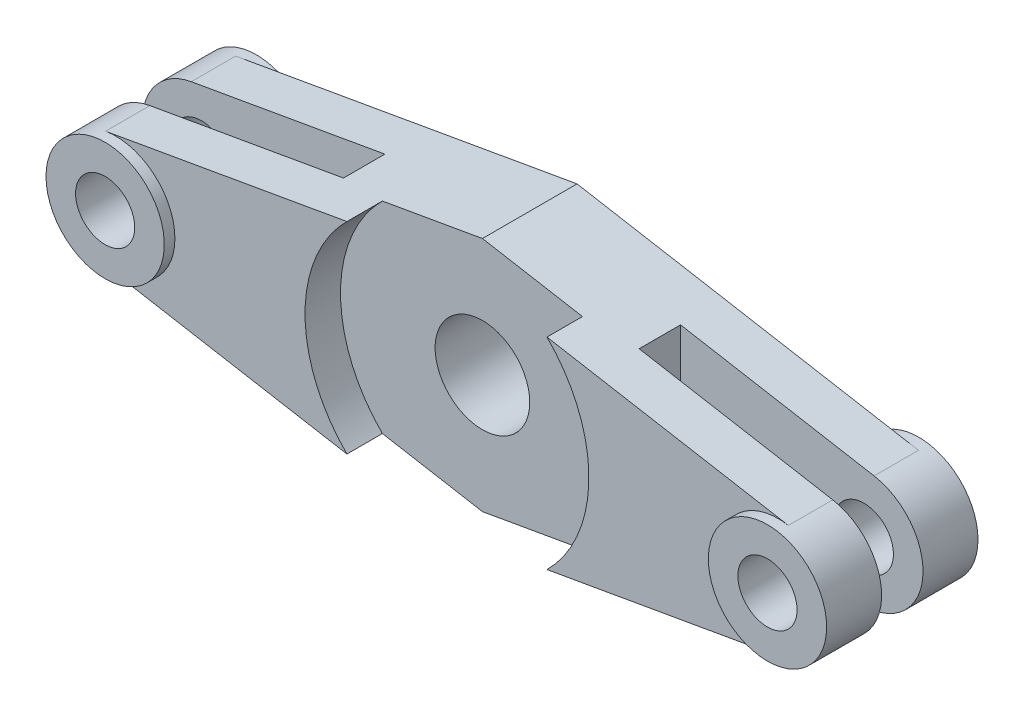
ISO-10303-21;
HEADER;
FILE_DESCRIPTION(('STEP AP214'),'2;1');
FILE_NAME('part.step','',(''),(''),'','','');
FILE_SCHEMA(('AUTOMOTIVE_DESIGN { 1 0 10303 214 1 1 1 1 }'));
ENDSEC;
DATA;
#1=APPLICATION_CONTEXT('core data for automotive mechanical design processes');
#2=APPLICATION_PROTOCOL_DEFINITION('international standard','automotive_design',2000,#1);
#3=PRODUCT_CONTEXT('',#1,'mechanical');
#4=PRODUCT('Part','Part','',(#3));
#5=PRODUCT_RELATED_PRODUCT_CATEGORY('part','',(#4));
#6=PRODUCT_DEFINITION_FORMATION('','',#4);
#7=PRODUCT_DEFINITION_CONTEXT('part definition',#1,'design');
#8=PRODUCT_DEFINITION('design','',#6,#7);
#9=PRODUCT_DEFINITION_SHAPE('','',#8);
#10=(LENGTH_UNIT() NAMED_UNIT(*) SI_UNIT(.MILLI.,.METRE.));
#11=(NAMED_UNIT(*) PLANE_ANGLE_UNIT() SI_UNIT($,.RADIAN.));
#12=(NAMED_UNIT(*) SI_UNIT($,.STERADIAN.) SOLID_ANGLE_UNIT());
#13=UNCERTAINTY_MEASURE_WITH_UNIT(LENGTH_MEASURE(1.E-05),#10,'distance_accuracy_value','');
#14=(GEOMETRIC_REPRESENTATION_CONTEXT(3) GLOBAL_UNCERTAINTY_ASSIGNED_CONTEXT((#13)) GLOBAL_UNIT_ASSIGNED_CONTEXT((#10,
#11,#12)) REPRESENTATION_CONTEXT('',''));
#15=CARTESIAN_POINT('',(0.,0.,0.));
#16=DIRECTION('',(0.,0.,1.));
#17=DIRECTION('',(1.,0.,0.));
#18=AXIS2_PLACEMENT_3D('',#15,#16,#17);
#19=CARTESIAN_POINT('',(28.,0.,5.5));
#20=DIRECTION('',(0.,0.,1.));
#21=DIRECTION('',(1.,0.,0.));
#22=AXIS2_PLACEMENT_3D('',#19,#20,#21);
#23=PLANE('',#22);
#24=CARTESIAN_POINT('',(0.,0.,5.5));
#25=DIRECTION('',(0.,0.,1.));
#26=DIRECTION('',(1.,0.,0.));
#27=AXIS2_PLACEMENT_3D('',#24,#25,#26);
#28=CIRCLE('',#27,12.);
#29=CARTESIAN_POINT('',(-8.45758715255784,8.5128855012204,5.5));
#30=VERTEX_POINT('',#29);
#31=CARTESIAN_POINT('',(-8.45758715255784,-8.5128855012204,5.5));
#32=VERTEX_POINT('',#31);
#33=EDGE_CURVE('E167',#30,#32,#28,.T.);
#34=ORIENTED_EDGE('',*,*,#33,.F.);
#35=DIRECTION('',(-0.984891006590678,-0.173175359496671,0.));
#36=VECTOR('',#35,1.);
#37=CARTESIAN_POINT('',(0.,10.,5.5));
#38=LINE('',#37,#36);
#39=CARTESIAN_POINT('',(-28.8658767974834,4.92445503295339,5.5));
#40=VERTEX_POINT('',#39);
#41=EDGE_CURVE('E184',#30,#40,#38,.T.);
#42=ORIENTED_EDGE('',*,*,#41,.T.);
#43=CARTESIAN_POINT('',(-28.,0.,5.5));
#44=DIRECTION('',(0.,0.,1.));
#45=DIRECTION('',(-1.,0.,0.));
#46=AXIS2_PLACEMENT_3D('',#43,#44,#45);
#47=CIRCLE('',#46,5.);
#48=CARTESIAN_POINT('',(-28.8658767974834,-4.92445503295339,5.5));
#49=VERTEX_POINT('',#48);
#50=EDGE_CURVE('E469',#49,#40,#47,.T.);
#51=ORIENTED_EDGE('',*,*,#50,.F.);
#52=DIRECTION('',(0.984891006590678,-0.173175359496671,0.));
#53=VECTOR('',#52,1.);
#54=CARTESIAN_POINT('',(0.,-10.,5.5));
#55=LINE('',#54,#53);
#56=EDGE_CURVE('E187',#49,#32,#55,.T.);
#57=ORIENTED_EDGE('',*,*,#56,.T.);
#58=EDGE_LOOP('',(#34,#42,#51,#57));
#59=FACE_BOUND('',#58,.T.);
#60=ADVANCED_FACE('F33',(#59),#23,.T.);
#61=CARTESIAN_POINT('',(-28.,0.,5.5));
#62=DIRECTION('',(0.,0.,-1.));
#63=DIRECTION('',(-1.,0.,0.));
#64=AXIS2_PLACEMENT_3D('',#61,#62,#63);
#65=CYLINDRICAL_SURFACE('',#64,5.);
#66=CARTESIAN_POINT('',(-28.,0.,6.4));
#67=DIRECTION('',(0.,0.,1.));
#68=DIRECTION('',(-1.,0.,0.));
#69=AXIS2_PLACEMENT_3D('',#66,#67,#68);
#70=CIRCLE('',#69,5.);
#71=CARTESIAN_POINT('',(-33.,0.,6.4));
#72=VERTEX_POINT('',#71);
#73=EDGE_CURVE('E470',#72,#72,#70,.T.);
#74=ORIENTED_EDGE('',*,*,#73,.F.);
#75=EDGE_LOOP('',(#74));
#76=FACE_BOUND('',#75,.T.);
#77=CARTESIAN_POINT('',(-28.,0.,1.75));
#78=DIRECTION('',(0.,0.,-1.));
#79=DIRECTION('',(-1.,0.,0.));
#80=AXIS2_PLACEMENT_3D('',#77,#78,#79);
#81=CIRCLE('',#80,5.);
#82=CARTESIAN_POINT('',(-28.8658767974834,-4.92445503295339,1.75));
#83=VERTEX_POINT('',#82);
#84=CARTESIAN_POINT('',(-28.8658767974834,4.92445503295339,1.75));
#85=VERTEX_POINT('',#84);
#86=EDGE_CURVE('E238',#83,#85,#81,.T.);
#87=ORIENTED_EDGE('',*,*,#86,.F.);
#88=DIRECTION('',(0.,0.,-1.));
#89=VECTOR('',#88,1.);
#90=CARTESIAN_POINT('',(-28.8658767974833,-4.92445503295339,5.5));
#91=LINE('',#90,#89);
#92=EDGE_CURVE('E444',#49,#83,#91,.T.);
#93=ORIENTED_EDGE('',*,*,#92,.F.);
#94=ORIENTED_EDGE('',*,*,#50,.T.);
#95=DIRECTION('',(0.,0.,-1.));
#96=VECTOR('',#95,1.);
#97=CARTESIAN_POINT('',(-28.8658767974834,4.92445503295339,5.5));
#98=LINE('',#97,#96);
#99=EDGE_CURVE('E447',#40,#85,#98,.T.);
#100=ORIENTED_EDGE('',*,*,#99,.T.);
#101=EDGE_LOOP('',(#87,#93,#94,#100));
#102=FACE_BOUND('',#101,.T.);
#103=ADVANCED_FACE('F349',(#76,#102),#65,.T.);
#104=CARTESIAN_POINT('',(-28.,0.,5.5));
#105=DIRECTION('',(0.,0.,-1.));
#106=DIRECTION('',(-1.,0.,0.));
#107=AXIS2_PLACEMENT_3D('',#104,#105,#106);
#108=CYLINDRICAL_SURFACE('',#107,2.5);
#109=CARTESIAN_POINT('',(-28.,0.,6.4));
#110=DIRECTION('',(0.,0.,1.));
#111=DIRECTION('',(-1.,0.,0.));
#112=AXIS2_PLACEMENT_3D('',#109,#110,#111);
#113=CIRCLE('',#112,2.5);
#114=CARTESIAN_POINT('',(-30.5,0.,6.4));
#115=VERTEX_POINT('',#114);
#116=EDGE_CURVE('E292',#115,#115,#113,.T.);
#117=ORIENTED_EDGE('',*,*,#116,.T.);
#118=EDGE_LOOP('',(#117));
#119=FACE_BOUND('',#118,.T.);
#120=CARTESIAN_POINT('',(-28.,0.,1.75));
#121=DIRECTION('',(0.,0.,-1.));
#122=DIRECTION('',(-1.,0.,0.));
#123=AXIS2_PLACEMENT_3D('',#120,#121,#122);
#124=CIRCLE('',#123,2.5);
#125=CARTESIAN_POINT('',(-30.5,0.,1.75));
#126=VERTEX_POINT('',#125);
#127=EDGE_CURVE('E225',#126,#126,#124,.T.);
#128=ORIENTED_EDGE('',*,*,#127,.T.);
#129=EDGE_LOOP('',(#128));
#130=FACE_BOUND('',#129,.T.);
#131=ADVANCED_FACE('F346',(#119,#130),#108,.F.);
#132=CARTESIAN_POINT('',(28.,0.,5.5));
#133=DIRECTION('',(0.,0.,-1.));
#134=DIRECTION('',(-1.,0.,0.));
#135=AXIS2_PLACEMENT_3D('',#132,#133,#134);
#136=CYLINDRICAL_SURFACE('',#135,5.);
#137=CARTESIAN_POINT('',(28.,0.,6.4));
#138=DIRECTION('',(0.,0.,1.));
#139=DIRECTION('',(1.,0.,0.));
#140=AXIS2_PLACEMENT_3D('',#137,#138,#139);
#141=CIRCLE('',#140,5.);
#142=CARTESIAN_POINT('',(33.,0.,6.4));
#143=VERTEX_POINT('',#142);
#144=EDGE_CURVE('E304',#143,#143,#141,.T.);
#145=ORIENTED_EDGE('',*,*,#144,.F.);
#146=EDGE_LOOP('',(#145));
#147=FACE_BOUND('',#146,.T.);
#148=CARTESIAN_POINT('',(28.,0.,1.75));
#149=DIRECTION('',(0.,0.,-1.));
#150=DIRECTION('',(-1.,0.,0.));
#151=AXIS2_PLACEMENT_3D('',#148,#149,#150);
#152=CIRCLE('',#151,5.);
#153=CARTESIAN_POINT('',(28.8658767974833,4.92445503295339,1.75));
#154=VERTEX_POINT('',#153);
#155=CARTESIAN_POINT('',(28.8658767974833,-4.92445503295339,1.75));
#156=VERTEX_POINT('',#155);
#157=EDGE_CURVE('E260',#154,#156,#152,.T.);
#158=ORIENTED_EDGE('',*,*,#157,.F.);
#159=DIRECTION('',(0.,0.,-1.));
#160=VECTOR('',#159,1.);
#161=CARTESIAN_POINT('',(28.8658767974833,4.92445503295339,5.5));
#162=LINE('',#161,#160);
#163=CARTESIAN_POINT('',(28.8658767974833,4.92445503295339,5.5));
#164=VERTEX_POINT('',#163);
#165=EDGE_CURVE('E214',#164,#154,#162,.T.);
#166=ORIENTED_EDGE('',*,*,#165,.F.);
#167=CARTESIAN_POINT('',(28.,0.,5.5));
#168=DIRECTION('',(0.,0.,1.));
#169=DIRECTION('',(1.,0.,0.));
#170=AXIS2_PLACEMENT_3D('',#167,#168,#169);
#171=CIRCLE('',#170,5.);
#172=CARTESIAN_POINT('',(28.8658767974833,-4.92445503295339,5.5));
#173=VERTEX_POINT('',#172);
#174=EDGE_CURVE('E183',#164,#173,#171,.T.);
#175=ORIENTED_EDGE('',*,*,#174,.T.);
#176=DIRECTION('',(0.,0.,-1.));
#177=VECTOR('',#176,1.);
#178=CARTESIAN_POINT('',(28.8658767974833,-4.92445503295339,5.5));
#179=LINE('',#178,#177);
#180=EDGE_CURVE('E200',#173,#156,#179,.T.);
#181=ORIENTED_EDGE('',*,*,#180,.T.);
#182=EDGE_LOOP('',(#158,#166,#175,#181));
#183=FACE_BOUND('',#182,.T.);
#184=ADVANCED_FACE('F336',(#147,#183),#136,.T.);
#185=CARTESIAN_POINT('',(28.,0.,5.5));
#186=DIRECTION('',(0.,0.,-1.));
#187=DIRECTION('',(-1.,0.,0.));
#188=AXIS2_PLACEMENT_3D('',#185,#186,#187);
#189=CYLINDRICAL_SURFACE('',#188,2.5);
#190=CARTESIAN_POINT('',(28.,0.,6.4));
#191=DIRECTION('',(0.,0.,1.));
#192=DIRECTION('',(1.,0.,0.));
#193=AXIS2_PLACEMENT_3D('',#190,#191,#192);
#194=CIRCLE('',#193,2.5);
#195=CARTESIAN_POINT('',(30.5,0.,6.4));
#196=VERTEX_POINT('',#195);
#197=EDGE_CURVE('E463',#196,#196,#194,.T.);
#198=ORIENTED_EDGE('',*,*,#197,.T.);
#199=EDGE_LOOP('',(#198));
#200=FACE_BOUND('',#199,.T.);
#201=CARTESIAN_POINT('',(28.,0.,1.75));
#202=DIRECTION('',(0.,0.,-1.));
#203=DIRECTION('',(-1.,0.,0.));
#204=AXIS2_PLACEMENT_3D('',#201,#202,#203);
#205=CIRCLE('',#204,2.5);
#206=CARTESIAN_POINT('',(25.5,0.,1.75));
#207=VERTEX_POINT('',#206);
#208=EDGE_CURVE('E257',#207,#207,#205,.T.);
#209=ORIENTED_EDGE('',*,*,#208,.T.);
#210=EDGE_LOOP('',(#209));
#211=FACE_BOUND('',#210,.T.);
#212=ADVANCED_FACE('F322',(#200,#211),#189,.F.);
#213=CARTESIAN_POINT('',(8.45758715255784,-8.5128855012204,5.5));
#214=VERTEX_POINT('',#213);
#215=CARTESIAN_POINT('',(8.45758715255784,8.5128855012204,5.5));
#216=VERTEX_POINT('',#215);
#217=EDGE_CURVE('E158',#214,#216,#28,.T.);
#218=ORIENTED_EDGE('',*,*,#217,.F.);
#219=DIRECTION('',(0.984891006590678,0.173175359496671,0.));
#220=VECTOR('',#219,1.);
#221=CARTESIAN_POINT('',(0.,-10.,5.5));
#222=LINE('',#221,#220);
#223=EDGE_CURVE('E203',#214,#173,#222,.T.);
#224=ORIENTED_EDGE('',*,*,#223,.T.);
#225=ORIENTED_EDGE('',*,*,#174,.F.);
#226=DIRECTION('',(-0.984891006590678,0.173175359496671,0.));
#227=VECTOR('',#226,1.);
#228=CARTESIAN_POINT('',(0.,10.,5.5));
#229=LINE('',#228,#227);
#230=EDGE_CURVE('E175',#164,#216,#229,.T.);
#231=ORIENTED_EDGE('',*,*,#230,.T.);
#232=EDGE_LOOP('',(#218,#224,#225,#231));
#233=FACE_BOUND('',#232,.T.);
#234=ADVANCED_FACE('F181',(#233),#23,.T.);
#235=CARTESIAN_POINT('',(28.,0.,-5.5));
#236=DIRECTION('',(0.,0.,1.));
#237=DIRECTION('',(1.,0.,0.));
#238=AXIS2_PLACEMENT_3D('',#235,#236,#237);
#239=PLANE('',#238);
#240=CARTESIAN_POINT('',(0.,0.,-5.5));
#241=DIRECTION('',(0.,0.,1.));
#242=DIRECTION('',(1.,0.,0.));
#243=AXIS2_PLACEMENT_3D('',#240,#241,#242);
#244=CIRCLE('',#243,4.);
#245=CARTESIAN_POINT('',(4.,0.,-5.5));
#246=VERTEX_POINT('',#245);
#247=EDGE_CURVE('E168',#246,#246,#244,.T.);
#248=ORIENTED_EDGE('',*,*,#247,.T.);
#249=EDGE_LOOP('',(#248));
#250=FACE_BOUND('',#249,.T.);
#251=DIRECTION('',(0.984891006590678,-0.173175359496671,0.));
#252=VECTOR('',#251,1.);
#253=CARTESIAN_POINT('',(0.,-10.,-5.5));
#254=LINE('',#253,#252);
#255=CARTESIAN_POINT('',(-28.8658767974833,-4.92445503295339,-5.5));
#256=VERTEX_POINT('',#255);
#257=CARTESIAN_POINT('',(0.,-10.,-5.5));
#258=VERTEX_POINT('',#257);
#259=EDGE_CURVE('E190',#256,#258,#254,.T.);
#260=ORIENTED_EDGE('',*,*,#259,.F.);
#261=CARTESIAN_POINT('',(-28.,0.,-5.5));
#262=DIRECTION('',(0.,0.,1.));
#263=DIRECTION('',(-1.,0.,0.));
#264=AXIS2_PLACEMENT_3D('',#261,#262,#263);
#265=CIRCLE('',#264,5.);
#266=CARTESIAN_POINT('',(-28.8658767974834,4.92445503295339,-5.5));
#267=VERTEX_POINT('',#266);
#268=EDGE_CURVE('E279',#256,#267,#265,.T.);
#269=ORIENTED_EDGE('',*,*,#268,.T.);
#270=DIRECTION('',(-0.984891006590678,-0.173175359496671,0.));
#271=VECTOR('',#270,1.);
#272=CARTESIAN_POINT('',(0.,10.,-5.5));
#273=LINE('',#272,#271);
#274=CARTESIAN_POINT('',(0.,10.,-5.5));
#275=VERTEX_POINT('',#274);
#276=EDGE_CURVE('E303',#275,#267,#273,.T.);
#277=ORIENTED_EDGE('',*,*,#276,.F.);
#278=DIRECTION('',(-0.984891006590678,0.173175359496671,0.));
#279=VECTOR('',#278,1.);
#280=CARTESIAN_POINT('',(0.,10.,-5.5));
#281=LINE('',#280,#279);
#282=CARTESIAN_POINT('',(28.8658767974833,4.92445503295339,-5.5));
#283=VERTEX_POINT('',#282);
#284=EDGE_CURVE('E300',#283,#275,#281,.T.);
#285=ORIENTED_EDGE('',*,*,#284,.F.);
#286=CARTESIAN_POINT('',(28.,0.,-5.5));
#287=DIRECTION('',(0.,0.,1.));
#288=DIRECTION('',(1.,0.,0.));
#289=AXIS2_PLACEMENT_3D('',#286,#287,#288);
#290=CIRCLE('',#289,5.);
#291=CARTESIAN_POINT('',(28.8658767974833,-4.92445503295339,-5.5));
#292=VERTEX_POINT('',#291);
#293=EDGE_CURVE('E288',#283,#292,#290,.T.);
#294=ORIENTED_EDGE('',*,*,#293,.T.);
#295=DIRECTION('',(0.984891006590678,0.173175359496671,0.));
#296=VECTOR('',#295,1.);
#297=CARTESIAN_POINT('',(0.,-10.,-5.5));
#298=LINE('',#297,#296);
#299=EDGE_CURVE('E185',#258,#292,#298,.T.);
#300=ORIENTED_EDGE('',*,*,#299,.F.);
#301=EDGE_LOOP('',(#260,#269,#277,#285,#294,#300));
#302=FACE_BOUND('',#301,.T.);
#303=ADVANCED_FACE('F334',(#250,#302),#239,.F.);
#304=CARTESIAN_POINT('',(28.8658767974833,4.92445503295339,-1.75));
#305=VERTEX_POINT('',#304);
#306=EDGE_CURVE('E219',#305,#283,#162,.T.);
#307=ORIENTED_EDGE('',*,*,#306,.F.);
#308=CARTESIAN_POINT('',(28.,0.,-1.75));
#309=DIRECTION('',(0.,0.,-1.));
#310=DIRECTION('',(-1.,0.,0.));
#311=AXIS2_PLACEMENT_3D('',#308,#309,#310);
#312=CIRCLE('',#311,5.);
#313=CARTESIAN_POINT('',(28.8658767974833,-4.92445503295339,-1.75));
#314=VERTEX_POINT('',#313);
#315=EDGE_CURVE('E267',#305,#314,#312,.T.);
#316=ORIENTED_EDGE('',*,*,#315,.T.);
#317=EDGE_CURVE('E205',#314,#292,#179,.T.);
#318=ORIENTED_EDGE('',*,*,#317,.T.);
#319=ORIENTED_EDGE('',*,*,#293,.F.);
#320=EDGE_LOOP('',(#307,#316,#318,#319));
#321=FACE_BOUND('',#320,.T.);
#322=CARTESIAN_POINT('',(28.,0.,-6.4));
#323=DIRECTION('',(0.,0.,1.));
#324=DIRECTION('',(1.,0.,0.));
#325=AXIS2_PLACEMENT_3D('',#322,#323,#324);
#326=CIRCLE('',#325,5.);
#327=CARTESIAN_POINT('',(33.,0.,-6.4));
#328=VERTEX_POINT('',#327);
#329=EDGE_CURVE('E289',#328,#328,#326,.T.);
#330=ORIENTED_EDGE('',*,*,#329,.T.);
#331=EDGE_LOOP('',(#330));
#332=FACE_BOUND('',#331,.T.);
#333=ADVANCED_FACE('F35',(#321,#332),#136,.T.);
#334=CARTESIAN_POINT('',(0.,10.,5.5));
#335=DIRECTION('',(-0.173175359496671,-0.984891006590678,0.));
#336=DIRECTION('',(0.984891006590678,-0.173175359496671,0.));
#337=AXIS2_PLACEMENT_3D('',#334,#335,#336);
#338=PLANE('',#337);
#339=DIRECTION('',(-0.984891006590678,0.173175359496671,0.));
#340=VECTOR('',#339,1.);
#341=CARTESIAN_POINT('',(0.,10.,2.5));
#342=LINE('',#341,#340);
#343=CARTESIAN_POINT('',(8.45758715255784,8.5128855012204,2.5));
#344=VERTEX_POINT('',#343);
#345=CARTESIAN_POINT('',(0.,10.,2.5));
#346=VERTEX_POINT('',#345);
#347=EDGE_CURVE('E178',#344,#346,#342,.T.);
#348=ORIENTED_EDGE('',*,*,#347,.F.);
#349=DIRECTION('',(0.,0.,1.));
#350=VECTOR('',#349,1.);
#351=CARTESIAN_POINT('',(8.45758715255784,8.5128855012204,2.5));
#352=LINE('',#351,#350);
#353=EDGE_CURVE('E162',#344,#216,#352,.T.);
#354=ORIENTED_EDGE('',*,*,#353,.T.);
#355=ORIENTED_EDGE('',*,*,#230,.F.);
#356=ORIENTED_EDGE('',*,*,#165,.T.);
#357=DIRECTION('',(0.984891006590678,-0.173175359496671,0.));
#358=VECTOR('',#357,1.);
#359=CARTESIAN_POINT('',(0.,10.,1.75));
#360=LINE('',#359,#358);
#361=CARTESIAN_POINT('',(12.5,7.80209994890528,1.75));
#362=VERTEX_POINT('',#361);
#363=EDGE_CURVE('E262',#362,#154,#360,.T.);
#364=ORIENTED_EDGE('',*,*,#363,.F.);
#365=DIRECTION('',(0.,0.,-1.));
#366=VECTOR('',#365,1.);
#367=CARTESIAN_POINT('',(12.5,7.80209994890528,5.5));
#368=LINE('',#367,#366);
#369=CARTESIAN_POINT('',(12.5,7.80209994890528,-1.75));
#370=VERTEX_POINT('',#369);
#371=EDGE_CURVE('E273',#362,#370,#368,.T.);
#372=ORIENTED_EDGE('',*,*,#371,.T.);
#373=DIRECTION('',(0.984891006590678,-0.173175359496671,0.));
#374=VECTOR('',#373,1.);
#375=CARTESIAN_POINT('',(0.,10.,-1.75));
#376=LINE('',#375,#374);
#377=EDGE_CURVE('E270',#370,#305,#376,.T.);
#378=ORIENTED_EDGE('',*,*,#377,.T.);
#379=ORIENTED_EDGE('',*,*,#306,.T.);
#380=ORIENTED_EDGE('',*,*,#284,.T.);
#381=DIRECTION('',(0.,0.,-1.));
#382=VECTOR('',#381,1.);
#383=CARTESIAN_POINT('',(0.,10.,5.5));
#384=LINE('',#383,#382);
#385=EDGE_CURVE('E224',#346,#275,#384,.T.);
#386=ORIENTED_EDGE('',*,*,#385,.F.);
#387=EDGE_LOOP('',(#348,#354,#355,#356,#364,#372,#378,#379,#380,#386));
#388=FACE_BOUND('',#387,.T.);
#389=ADVANCED_FACE('F173',(#388),#338,.F.);
#390=CARTESIAN_POINT('',(0.,10.,5.5));
#391=DIRECTION('',(0.173175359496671,-0.984891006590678,0.));
#392=DIRECTION('',(0.984891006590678,0.173175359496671,0.));
#393=AXIS2_PLACEMENT_3D('',#390,#391,#392);
#394=PLANE('',#393);
#395=ORIENTED_EDGE('',*,*,#41,.F.);
#396=DIRECTION('',(0.,0.,1.));
#397=VECTOR('',#396,1.);
#398=CARTESIAN_POINT('',(-8.45758715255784,8.5128855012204,2.5));
#399=LINE('',#398,#397);
#400=CARTESIAN_POINT('',(-8.45758715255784,8.5128855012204,2.5));
#401=VERTEX_POINT('',#400);
#402=EDGE_CURVE('E179',#30,#401,#399,.F.);
#403=ORIENTED_EDGE('',*,*,#402,.T.);
#404=DIRECTION('',(-0.984891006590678,-0.173175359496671,0.));
#405=VECTOR('',#404,1.);
#406=CARTESIAN_POINT('',(0.,10.,2.5));
#407=LINE('',#406,#405);
#408=EDGE_CURVE('E428',#346,#401,#407,.T.);
#409=ORIENTED_EDGE('',*,*,#408,.F.);
#410=ORIENTED_EDGE('',*,*,#385,.T.);
#411=ORIENTED_EDGE('',*,*,#276,.T.);
#412=CARTESIAN_POINT('',(-28.8658767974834,4.92445503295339,-1.75));
#413=VERTEX_POINT('',#412);
#414=EDGE_CURVE('E450',#413,#267,#98,.T.);
#415=ORIENTED_EDGE('',*,*,#414,.F.);
#416=DIRECTION('',(0.984891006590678,0.173175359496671,0.));
#417=VECTOR('',#416,1.);
#418=CARTESIAN_POINT('',(0.,10.,-1.75));
#419=LINE('',#418,#417);
#420=CARTESIAN_POINT('',(-12.5,7.80209994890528,-1.75));
#421=VERTEX_POINT('',#420);
#422=EDGE_CURVE('E246',#413,#421,#419,.T.);
#423=ORIENTED_EDGE('',*,*,#422,.T.);
#424=DIRECTION('',(0.,0.,-1.));
#425=VECTOR('',#424,1.);
#426=CARTESIAN_POINT('',(-12.5,7.80209994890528,5.5));
#427=LINE('',#426,#425);
#428=CARTESIAN_POINT('',(-12.5,7.80209994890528,1.75));
#429=VERTEX_POINT('',#428);
#430=EDGE_CURVE('E249',#429,#421,#427,.T.);
#431=ORIENTED_EDGE('',*,*,#430,.F.);
#432=DIRECTION('',(0.984891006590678,0.173175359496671,0.));
#433=VECTOR('',#432,1.);
#434=CARTESIAN_POINT('',(0.,10.,1.75));
#435=LINE('',#434,#433);
#436=EDGE_CURVE('E232',#85,#429,#435,.T.);
#437=ORIENTED_EDGE('',*,*,#436,.F.);
#438=ORIENTED_EDGE('',*,*,#99,.F.);
#439=EDGE_LOOP('',(#395,#403,#409,#410,#411,#415,#423,#431,#437,#438));
#440=FACE_BOUND('',#439,.T.);
#441=ADVANCED_FACE('F341',(#440),#394,.F.);
#442=CARTESIAN_POINT('',(-28.8658767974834,-4.92445503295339,-1.75));
#443=VERTEX_POINT('',#442);
#444=EDGE_CURVE('E451',#443,#256,#91,.T.);
#445=ORIENTED_EDGE('',*,*,#444,.F.);
#446=CARTESIAN_POINT('',(-28.,0.,-1.75));
#447=DIRECTION('',(0.,0.,-1.));
#448=DIRECTION('',(-1.,0.,0.));
#449=AXIS2_PLACEMENT_3D('',#446,#447,#448);
#450=CIRCLE('',#449,5.);
#451=EDGE_CURVE('E236',#443,#413,#450,.T.);
#452=ORIENTED_EDGE('',*,*,#451,.T.);
#453=ORIENTED_EDGE('',*,*,#414,.T.);
#454=ORIENTED_EDGE('',*,*,#268,.F.);
#455=EDGE_LOOP('',(#445,#452,#453,#454));
#456=FACE_BOUND('',#455,.T.);
#457=CARTESIAN_POINT('',(-28.,0.,-6.4));
#458=DIRECTION('',(0.,0.,1.));
#459=DIRECTION('',(-1.,0.,0.));
#460=AXIS2_PLACEMENT_3D('',#457,#458,#459);
#461=CIRCLE('',#460,5.);
#462=CARTESIAN_POINT('',(-33.,0.,-6.4));
#463=VERTEX_POINT('',#462);
#464=EDGE_CURVE('E282',#463,#463,#461,.T.);
#465=ORIENTED_EDGE('',*,*,#464,.T.);
#466=EDGE_LOOP('',(#465));
#467=FACE_BOUND('',#466,.T.);
#468=ADVANCED_FACE('F357',(#456,#467),#65,.T.);
#469=CARTESIAN_POINT('',(0.,-10.,5.5));
#470=DIRECTION('',(0.173175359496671,0.984891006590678,0.));
#471=DIRECTION('',(-0.984891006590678,0.173175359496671,0.));
#472=AXIS2_PLACEMENT_3D('',#469,#470,#471);
#473=PLANE('',#472);
#474=DIRECTION('',(0.984891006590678,-0.173175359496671,0.));
#475=VECTOR('',#474,1.);
#476=CARTESIAN_POINT('',(0.,-10.,2.5));
#477=LINE('',#476,#475);
#478=CARTESIAN_POINT('',(-8.45758715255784,-8.5128855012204,2.5));
#479=VERTEX_POINT('',#478);
#480=CARTESIAN_POINT('',(0.,-10.,2.5));
#481=VERTEX_POINT('',#480);
#482=EDGE_CURVE('E48',#479,#481,#477,.T.);
#483=ORIENTED_EDGE('',*,*,#482,.F.);
#484=DIRECTION('',(0.,0.,1.));
#485=VECTOR('',#484,1.);
#486=CARTESIAN_POINT('',(-8.45758715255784,-8.5128855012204,2.5));
#487=LINE('',#486,#485);
#488=EDGE_CURVE('E431',#479,#32,#487,.T.);
#489=ORIENTED_EDGE('',*,*,#488,.T.);
#490=ORIENTED_EDGE('',*,*,#56,.F.);
#491=ORIENTED_EDGE('',*,*,#92,.T.);
#492=DIRECTION('',(-0.984891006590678,0.173175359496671,0.));
#493=VECTOR('',#492,1.);
#494=CARTESIAN_POINT('',(0.,-10.,1.75));
#495=LINE('',#494,#493);
#496=CARTESIAN_POINT('',(-12.5,-7.80209994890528,1.75));
#497=VERTEX_POINT('',#496);
#498=EDGE_CURVE('E227',#497,#83,#495,.T.);
#499=ORIENTED_EDGE('',*,*,#498,.F.);
#500=DIRECTION('',(0.,0.,1.));
#501=VECTOR('',#500,1.);
#502=CARTESIAN_POINT('',(-12.5,-7.80209994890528,5.5));
#503=LINE('',#502,#501);
#504=CARTESIAN_POINT('',(-12.5,-7.80209994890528,-1.75));
#505=VERTEX_POINT('',#504);
#506=EDGE_CURVE('E206',#505,#497,#503,.T.);
#507=ORIENTED_EDGE('',*,*,#506,.F.);
#508=DIRECTION('',(-0.984891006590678,0.173175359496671,0.));
#509=VECTOR('',#508,1.);
#510=CARTESIAN_POINT('',(0.,-10.,-1.75));
#511=LINE('',#510,#509);
#512=EDGE_CURVE('E231',#505,#443,#511,.T.);
#513=ORIENTED_EDGE('',*,*,#512,.T.);
#514=ORIENTED_EDGE('',*,*,#444,.T.);
#515=ORIENTED_EDGE('',*,*,#259,.T.);
#516=DIRECTION('',(0.,0.,-1.));
#517=VECTOR('',#516,1.);
#518=CARTESIAN_POINT('',(0.,-10.,5.5));
#519=LINE('',#518,#517);
#520=EDGE_CURVE('E454',#481,#258,#519,.T.);
#521=ORIENTED_EDGE('',*,*,#520,.F.);
#522=EDGE_LOOP('',(#483,#489,#490,#491,#499,#507,#513,#514,#515,#521));
#523=FACE_BOUND('',#522,.T.);
#524=ADVANCED_FACE('F448',(#523),#473,.F.);
#525=CARTESIAN_POINT('',(0.,-10.,5.5));
#526=DIRECTION('',(-0.173175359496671,0.984891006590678,0.));
#527=DIRECTION('',(-0.984891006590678,-0.173175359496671,0.));
#528=AXIS2_PLACEMENT_3D('',#525,#526,#527);
#529=PLANE('',#528);
#530=ORIENTED_EDGE('',*,*,#223,.F.);
#531=DIRECTION('',(0.,0.,1.));
#532=VECTOR('',#531,1.);
#533=CARTESIAN_POINT('',(8.45758715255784,-8.5128855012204,2.5));
#534=LINE('',#533,#532);
#535=CARTESIAN_POINT('',(8.45758715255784,-8.5128855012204,2.5));
#536=VERTEX_POINT('',#535);
#537=EDGE_CURVE('E11',#214,#536,#534,.F.);
#538=ORIENTED_EDGE('',*,*,#537,.T.);
#539=DIRECTION('',(0.984891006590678,0.173175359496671,0.));
#540=VECTOR('',#539,1.);
#541=CARTESIAN_POINT('',(0.,-10.,2.5));
#542=LINE('',#541,#540);
#543=EDGE_CURVE('E41',#481,#536,#542,.T.);
#544=ORIENTED_EDGE('',*,*,#543,.F.);
#545=ORIENTED_EDGE('',*,*,#520,.T.);
#546=ORIENTED_EDGE('',*,*,#299,.T.);
#547=ORIENTED_EDGE('',*,*,#317,.F.);
#548=DIRECTION('',(-0.984891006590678,-0.173175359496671,0.));
#549=VECTOR('',#548,1.);
#550=CARTESIAN_POINT('',(0.,-10.,-1.75));
#551=LINE('',#550,#549);
#552=CARTESIAN_POINT('',(12.5,-7.80209994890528,-1.75));
#553=VERTEX_POINT('',#552);
#554=EDGE_CURVE('E265',#314,#553,#551,.T.);
#555=ORIENTED_EDGE('',*,*,#554,.T.);
#556=DIRECTION('',(0.,0.,1.));
#557=VECTOR('',#556,1.);
#558=CARTESIAN_POINT('',(12.5,-7.80209994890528,5.5));
#559=LINE('',#558,#557);
#560=CARTESIAN_POINT('',(12.5,-7.80209994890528,1.75));
#561=VERTEX_POINT('',#560);
#562=EDGE_CURVE('E208',#553,#561,#559,.T.);
#563=ORIENTED_EDGE('',*,*,#562,.T.);
#564=DIRECTION('',(-0.984891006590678,-0.173175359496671,0.));
#565=VECTOR('',#564,1.);
#566=CARTESIAN_POINT('',(0.,-10.,1.75));
#567=LINE('',#566,#565);
#568=EDGE_CURVE('E258',#156,#561,#567,.T.);
#569=ORIENTED_EDGE('',*,*,#568,.F.);
#570=ORIENTED_EDGE('',*,*,#180,.F.);
#571=EDGE_LOOP('',(#530,#538,#544,#545,#546,#547,#555,#563,#569,#570));
#572=FACE_BOUND('',#571,.T.);
#573=ADVANCED_FACE('F320',(#572),#529,.F.);
#574=CARTESIAN_POINT('',(28.,0.,-1.75));
#575=DIRECTION('',(0.,0.,-1.));
#576=DIRECTION('',(-1.,0.,0.));
#577=AXIS2_PLACEMENT_3D('',#574,#575,#576);
#578=CIRCLE('',#577,2.5);
#579=CARTESIAN_POINT('',(25.5,0.,-1.75));
#580=VERTEX_POINT('',#579);
#581=EDGE_CURVE('E264',#580,#580,#578,.T.);
#582=ORIENTED_EDGE('',*,*,#581,.F.);
#583=EDGE_LOOP('',(#582));
#584=FACE_BOUND('',#583,.T.);
#585=CARTESIAN_POINT('',(28.,0.,-6.4));
#586=DIRECTION('',(0.,0.,1.));
#587=DIRECTION('',(1.,0.,0.));
#588=AXIS2_PLACEMENT_3D('',#585,#586,#587);
#589=CIRCLE('',#588,2.5);
#590=CARTESIAN_POINT('',(30.5,0.,-6.4));
#591=VERTEX_POINT('',#590);
#592=EDGE_CURVE('E285',#591,#591,#589,.T.);
#593=ORIENTED_EDGE('',*,*,#592,.F.);
#594=EDGE_LOOP('',(#593));
#595=FACE_BOUND('',#594,.T.);
#596=ADVANCED_FACE('F316',(#584,#595),#189,.F.);
#597=CARTESIAN_POINT('',(-28.,0.,-1.75));
#598=DIRECTION('',(0.,0.,-1.));
#599=DIRECTION('',(-1.,0.,0.));
#600=AXIS2_PLACEMENT_3D('',#597,#598,#599);
#601=CIRCLE('',#600,2.5);
#602=CARTESIAN_POINT('',(-30.5,0.,-1.75));
#603=VERTEX_POINT('',#602);
#604=EDGE_CURVE('E229',#603,#603,#601,.T.);
#605=ORIENTED_EDGE('',*,*,#604,.F.);
#606=EDGE_LOOP('',(#605));
#607=FACE_BOUND('',#606,.T.);
#608=CARTESIAN_POINT('',(-28.,0.,-6.4));
#609=DIRECTION('',(0.,0.,1.));
#610=DIRECTION('',(-1.,0.,0.));
#611=AXIS2_PLACEMENT_3D('',#608,#609,#610);
#612=CIRCLE('',#611,2.5);
#613=CARTESIAN_POINT('',(-30.5,0.,-6.4));
#614=VERTEX_POINT('',#613);
#615=EDGE_CURVE('E276',#614,#614,#612,.T.);
#616=ORIENTED_EDGE('',*,*,#615,.F.);
#617=EDGE_LOOP('',(#616));
#618=FACE_BOUND('',#617,.T.);
#619=ADVANCED_FACE('F319',(#607,#618),#108,.F.);
#620=CARTESIAN_POINT('',(28.,0.,6.4));
#621=DIRECTION('',(0.,0.,1.));
#622=DIRECTION('',(1.,0.,0.));
#623=AXIS2_PLACEMENT_3D('',#620,#621,#622);
#624=PLANE('',#623);
#625=ORIENTED_EDGE('',*,*,#144,.T.);
#626=EDGE_LOOP('',(#625));
#627=FACE_BOUND('',#626,.T.);
#628=ORIENTED_EDGE('',*,*,#197,.F.);
#629=EDGE_LOOP('',(#628));
#630=FACE_BOUND('',#629,.T.);
#631=ADVANCED_FACE('F372',(#627,#630),#624,.T.);
#632=CARTESIAN_POINT('',(-28.,0.,6.4));
#633=DIRECTION('',(0.,0.,-1.));
#634=DIRECTION('',(-1.,0.,0.));
#635=AXIS2_PLACEMENT_3D('',#632,#633,#634);
#636=PLANE('',#635);
#637=ORIENTED_EDGE('',*,*,#73,.T.);
#638=EDGE_LOOP('',(#637));
#639=FACE_BOUND('',#638,.T.);
#640=ORIENTED_EDGE('',*,*,#116,.F.);
#641=EDGE_LOOP('',(#640));
#642=FACE_BOUND('',#641,.T.);
#643=ADVANCED_FACE('F329',(#639,#642),#636,.F.);
#644=CARTESIAN_POINT('',(28.,0.,-6.4));
#645=DIRECTION('',(0.,0.,-1.));
#646=DIRECTION('',(1.,0.,0.));
#647=AXIS2_PLACEMENT_3D('',#644,#645,#646);
#648=PLANE('',#647);
#649=ORIENTED_EDGE('',*,*,#592,.T.);
#650=EDGE_LOOP('',(#649));
#651=FACE_BOUND('',#650,.T.);
#652=ORIENTED_EDGE('',*,*,#329,.F.);
#653=EDGE_LOOP('',(#652));
#654=FACE_BOUND('',#653,.T.);
#655=ADVANCED_FACE('F325',(#651,#654),#648,.T.);
#656=CARTESIAN_POINT('',(-28.,0.,-6.4));
#657=DIRECTION('',(0.,0.,1.));
#658=DIRECTION('',(-1.,0.,0.));
#659=AXIS2_PLACEMENT_3D('',#656,#657,#658);
#660=PLANE('',#659);
#661=ORIENTED_EDGE('',*,*,#615,.T.);
#662=EDGE_LOOP('',(#661));
#663=FACE_BOUND('',#662,.T.);
#664=ORIENTED_EDGE('',*,*,#464,.F.);
#665=EDGE_LOOP('',(#664));
#666=FACE_BOUND('',#665,.T.);
#667=ADVANCED_FACE('F328',(#663,#666),#660,.F.);
#668=CARTESIAN_POINT('',(12.5,11.3080168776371,-1.75));
#669=DIRECTION('',(-1.,0.,0.));
#670=DIRECTION('',(0.,-1.,0.));
#671=AXIS2_PLACEMENT_3D('',#668,#669,#670);
#672=PLANE('',#671);
#673=DIRECTION('',(0.,-1.,0.));
#674=VECTOR('',#673,1.);
#675=CARTESIAN_POINT('',(12.5,11.3080168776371,1.75));
#676=LINE('',#675,#674);
#677=EDGE_CURVE('E251',#362,#561,#676,.T.);
#678=ORIENTED_EDGE('',*,*,#677,.T.);
#679=ORIENTED_EDGE('',*,*,#562,.F.);
#680=DIRECTION('',(0.,-1.,0.));
#681=VECTOR('',#680,1.);
#682=CARTESIAN_POINT('',(12.5,11.3080168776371,-1.75));
#683=LINE('',#682,#681);
#684=EDGE_CURVE('E254',#370,#553,#683,.T.);
#685=ORIENTED_EDGE('',*,*,#684,.F.);
#686=ORIENTED_EDGE('',*,*,#371,.F.);
#687=EDGE_LOOP('',(#678,#679,#685,#686));
#688=FACE_BOUND('',#687,.T.);
#689=ADVANCED_FACE('F382',(#688),#672,.F.);
#690=CARTESIAN_POINT('',(12.5,11.3080168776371,-1.75));
#691=DIRECTION('',(0.,0.,-1.));
#692=DIRECTION('',(-1.,0.,0.));
#693=AXIS2_PLACEMENT_3D('',#690,#691,#692);
#694=PLANE('',#693);
#695=ORIENTED_EDGE('',*,*,#581,.T.);
#696=EDGE_LOOP('',(#695));
#697=FACE_BOUND('',#696,.T.);
#698=ORIENTED_EDGE('',*,*,#684,.T.);
#699=ORIENTED_EDGE('',*,*,#554,.F.);
#700=ORIENTED_EDGE('',*,*,#315,.F.);
#701=ORIENTED_EDGE('',*,*,#377,.F.);
#702=EDGE_LOOP('',(#698,#699,#700,#701));
#703=FACE_BOUND('',#702,.T.);
#704=ADVANCED_FACE('F313',(#697,#703),#694,.F.);
#705=CARTESIAN_POINT('',(12.5,11.3080168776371,1.75));
#706=DIRECTION('',(0.,0.,-1.));
#707=DIRECTION('',(-1.,0.,0.));
#708=AXIS2_PLACEMENT_3D('',#705,#706,#707);
#709=PLANE('',#708);
#710=ORIENTED_EDGE('',*,*,#208,.F.);
#711=EDGE_LOOP('',(#710));
#712=FACE_BOUND('',#711,.T.);
#713=ORIENTED_EDGE('',*,*,#363,.T.);
#714=ORIENTED_EDGE('',*,*,#157,.T.);
#715=ORIENTED_EDGE('',*,*,#568,.T.);
#716=ORIENTED_EDGE('',*,*,#677,.F.);
#717=EDGE_LOOP('',(#713,#714,#715,#716));
#718=FACE_BOUND('',#717,.T.);
#719=ADVANCED_FACE('F389',(#712,#718),#709,.T.);
#720=CARTESIAN_POINT('',(-12.5,11.3080168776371,-1.75));
#721=DIRECTION('',(-1.,0.,0.));
#722=DIRECTION('',(0.,-1.,0.));
#723=AXIS2_PLACEMENT_3D('',#720,#721,#722);
#724=PLANE('',#723);
#725=ORIENTED_EDGE('',*,*,#430,.T.);
#726=DIRECTION('',(0.,-1.,0.));
#727=VECTOR('',#726,1.);
#728=CARTESIAN_POINT('',(-12.5,11.3080168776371,-1.75));
#729=LINE('',#728,#727);
#730=EDGE_CURVE('E228',#421,#505,#729,.T.);
#731=ORIENTED_EDGE('',*,*,#730,.T.);
#732=ORIENTED_EDGE('',*,*,#506,.T.);
#733=DIRECTION('',(0.,-1.,0.));
#734=VECTOR('',#733,1.);
#735=CARTESIAN_POINT('',(-12.5,11.3080168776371,1.75));
#736=LINE('',#735,#734);
#737=EDGE_CURVE('E56',#429,#497,#736,.T.);
#738=ORIENTED_EDGE('',*,*,#737,.F.);
#739=EDGE_LOOP('',(#725,#731,#732,#738));
#740=FACE_BOUND('',#739,.T.);
#741=ADVANCED_FACE('F392',(#740),#724,.T.);
#742=CARTESIAN_POINT('',(-12.5,11.3080168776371,-1.75));
#743=DIRECTION('',(0.,0.,-1.));
#744=DIRECTION('',(1.,0.,0.));
#745=AXIS2_PLACEMENT_3D('',#742,#743,#744);
#746=PLANE('',#745);
#747=ORIENTED_EDGE('',*,*,#604,.T.);
#748=EDGE_LOOP('',(#747));
#749=FACE_BOUND('',#748,.T.);
#750=ORIENTED_EDGE('',*,*,#451,.F.);
#751=ORIENTED_EDGE('',*,*,#512,.F.);
#752=ORIENTED_EDGE('',*,*,#730,.F.);
#753=ORIENTED_EDGE('',*,*,#422,.F.);
#754=EDGE_LOOP('',(#750,#751,#752,#753));
#755=FACE_BOUND('',#754,.T.);
#756=ADVANCED_FACE('F396',(#749,#755),#746,.F.);
#757=CARTESIAN_POINT('',(-12.5,11.3080168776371,1.75));
#758=DIRECTION('',(0.,0.,-1.));
#759=DIRECTION('',(1.,0.,0.));
#760=AXIS2_PLACEMENT_3D('',#757,#758,#759);
#761=PLANE('',#760);
#762=ORIENTED_EDGE('',*,*,#127,.F.);
#763=EDGE_LOOP('',(#762));
#764=FACE_BOUND('',#763,.T.);
#765=ORIENTED_EDGE('',*,*,#436,.T.);
#766=ORIENTED_EDGE('',*,*,#737,.T.);
#767=ORIENTED_EDGE('',*,*,#498,.T.);
#768=ORIENTED_EDGE('',*,*,#86,.T.);
#769=EDGE_LOOP('',(#765,#766,#767,#768));
#770=FACE_BOUND('',#769,.T.);
#771=ADVANCED_FACE('F399',(#764,#770),#761,.T.);
#772=CARTESIAN_POINT('',(0.,0.,2.5));
#773=DIRECTION('',(0.,0.,1.));
#774=DIRECTION('',(1.,0.,0.));
#775=AXIS2_PLACEMENT_3D('',#772,#773,#774);
#776=CYLINDRICAL_SURFACE('',#775,12.);
#777=CARTESIAN_POINT('',(0.,0.,2.5));
#778=DIRECTION('',(0.,0.,1.));
#779=DIRECTION('',(1.,0.,0.));
#780=AXIS2_PLACEMENT_3D('',#777,#778,#779);
#781=CIRCLE('',#780,12.);
#782=EDGE_CURVE('E424',#536,#344,#781,.T.);
#783=ORIENTED_EDGE('',*,*,#782,.F.);
#784=ORIENTED_EDGE('',*,*,#537,.F.);
#785=ORIENTED_EDGE('',*,*,#217,.T.);
#786=ORIENTED_EDGE('',*,*,#353,.F.);
#787=EDGE_LOOP('',(#783,#784,#785,#786));
#788=FACE_BOUND('',#787,.T.);
#789=ADVANCED_FACE('F161',(#788),#776,.F.);
#790=ORIENTED_EDGE('',*,*,#33,.T.);
#791=ORIENTED_EDGE('',*,*,#488,.F.);
#792=EDGE_CURVE('E426',#401,#479,#781,.T.);
#793=ORIENTED_EDGE('',*,*,#792,.F.);
#794=ORIENTED_EDGE('',*,*,#402,.F.);
#795=EDGE_LOOP('',(#790,#791,#793,#794));
#796=FACE_BOUND('',#795,.T.);
#797=ADVANCED_FACE('F405',(#796),#776,.F.);
#798=CARTESIAN_POINT('',(0.,0.,2.5));
#799=DIRECTION('',(0.,0.,1.));
#800=DIRECTION('',(1.,0.,0.));
#801=AXIS2_PLACEMENT_3D('',#798,#799,#800);
#802=PLANE('',#801);
#803=CARTESIAN_POINT('',(0.,0.,2.5));
#804=DIRECTION('',(0.,0.,1.));
#805=DIRECTION('',(1.,0.,0.));
#806=AXIS2_PLACEMENT_3D('',#803,#804,#805);
#807=CIRCLE('',#806,4.);
#808=CARTESIAN_POINT('',(4.,0.,2.5));
#809=VERTEX_POINT('',#808);
#810=EDGE_CURVE('E418',#809,#809,#807,.T.);
#811=ORIENTED_EDGE('',*,*,#810,.F.);
#812=EDGE_LOOP('',(#811));
#813=FACE_BOUND('',#812,.T.);
#814=ORIENTED_EDGE('',*,*,#347,.T.);
#815=ORIENTED_EDGE('',*,*,#408,.T.);
#816=ORIENTED_EDGE('',*,*,#792,.T.);
#817=ORIENTED_EDGE('',*,*,#482,.T.);
#818=ORIENTED_EDGE('',*,*,#543,.T.);
#819=ORIENTED_EDGE('',*,*,#782,.T.);
#820=EDGE_LOOP('',(#814,#815,#816,#817,#818,#819));
#821=FACE_BOUND('',#820,.T.);
#822=ADVANCED_FACE('F406',(#813,#821),#802,.T.);
#823=CARTESIAN_POINT('',(0.,0.,-6.4));
#824=DIRECTION('',(0.,0.,1.));
#825=DIRECTION('',(1.,0.,0.));
#826=AXIS2_PLACEMENT_3D('',#823,#824,#825);
#827=CYLINDRICAL_SURFACE('',#826,4.);
#828=ORIENTED_EDGE('',*,*,#810,.T.);
#829=EDGE_LOOP('',(#828));
#830=FACE_BOUND('',#829,.T.);
#831=ORIENTED_EDGE('',*,*,#247,.F.);
#832=EDGE_LOOP('',(#831));
#833=FACE_BOUND('',#832,.T.);
#834=ADVANCED_FACE('F409',(#830,#833),#827,.F.);
#835=CLOSED_SHELL('',(#60,#103,#131,#184,#212,#234,#303,#333,#389,#441,#468,#524,#573,#596,#619,
#631,#643,#655,#667,#689,#704,#719,#741,#756,#771,#789,#797,#822,#834));
#836=MANIFOLD_SOLID_BREP('B2',#835);
#837=ADVANCED_BREP_SHAPE_REPRESENTATION('',(#18,#836),#14);
#838=SHAPE_DEFINITION_REPRESENTATION(#9,#837);
ENDSEC;
END-ISO-10303-21;
